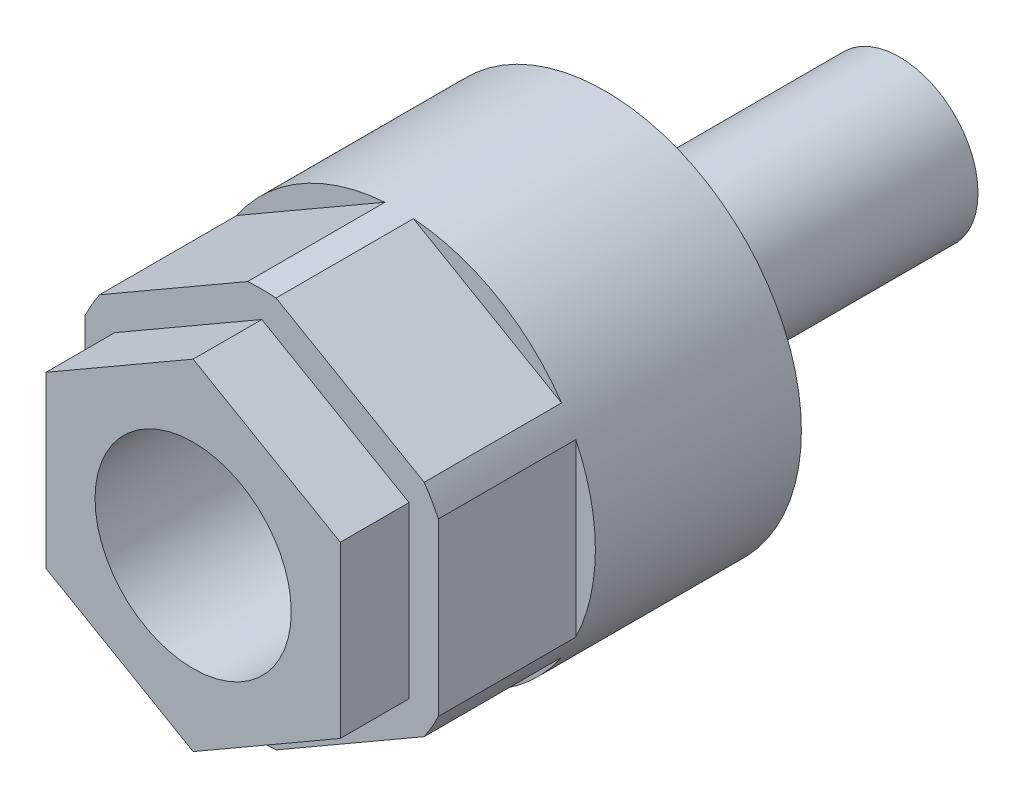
ISO-10303-21;
HEADER;
FILE_DESCRIPTION(('STEP AP214'),'2;1');
FILE_NAME('part.step','',(''),(''),'','','');
FILE_SCHEMA(('AUTOMOTIVE_DESIGN { 1 0 10303 214 1 1 1 1 }'));
ENDSEC;
DATA;
#1=APPLICATION_CONTEXT('core data for automotive mechanical design processes');
#2=APPLICATION_PROTOCOL_DEFINITION('international standard','automotive_design',2000,#1);
#3=PRODUCT_CONTEXT('',#1,'mechanical');
#4=PRODUCT('Part','Part','',(#3));
#5=PRODUCT_RELATED_PRODUCT_CATEGORY('part','',(#4));
#6=PRODUCT_DEFINITION_FORMATION('','',#4);
#7=PRODUCT_DEFINITION_CONTEXT('part definition',#1,'design');
#8=PRODUCT_DEFINITION('design','',#6,#7);
#9=PRODUCT_DEFINITION_SHAPE('','',#8);
#10=(LENGTH_UNIT() NAMED_UNIT(*) SI_UNIT(.MILLI.,.METRE.));
#11=(NAMED_UNIT(*) PLANE_ANGLE_UNIT() SI_UNIT($,.RADIAN.));
#12=(NAMED_UNIT(*) SI_UNIT($,.STERADIAN.) SOLID_ANGLE_UNIT());
#13=UNCERTAINTY_MEASURE_WITH_UNIT(LENGTH_MEASURE(1.E-05),#10,'distance_accuracy_value','');
#14=(GEOMETRIC_REPRESENTATION_CONTEXT(3) GLOBAL_UNCERTAINTY_ASSIGNED_CONTEXT((#13)) GLOBAL_UNIT_ASSIGNED_CONTEXT((#10,
#11,#12)) REPRESENTATION_CONTEXT('',''));
#15=CARTESIAN_POINT('',(0.,0.,0.));
#16=DIRECTION('',(0.,0.,1.));
#17=DIRECTION('',(1.,0.,0.));
#18=AXIS2_PLACEMENT_3D('',#15,#16,#17);
#19=CARTESIAN_POINT('',(0.,0.,80.));
#20=DIRECTION('',(0.,0.,1.));
#21=DIRECTION('',(1.,0.,0.));
#22=AXIS2_PLACEMENT_3D('',#19,#20,#21);
#23=CYLINDRICAL_SURFACE('',#22,20.);
#24=CARTESIAN_POINT('',(0.,0.,0.));
#25=DIRECTION('',(0.,0.,1.));
#26=DIRECTION('',(1.,0.,0.));
#27=AXIS2_PLACEMENT_3D('',#24,#25,#26);
#28=CIRCLE('',#27,20.);
#29=CARTESIAN_POINT('',(20.,0.,0.));
#30=VERTEX_POINT('',#29);
#31=EDGE_CURVE('E239',#30,#30,#28,.T.);
#32=ORIENTED_EDGE('',*,*,#31,.T.);
#33=EDGE_LOOP('',(#32));
#34=FACE_BOUND('',#33,.T.);
#35=DIRECTION('',(0.,0.,1.));
#36=VECTOR('',#35,1.);
#37=CARTESIAN_POINT('',(18.,-8.71779788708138,80.));
#38=LINE('',#37,#36);
#39=CARTESIAN_POINT('',(18.,-8.71779788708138,21.));
#40=VERTEX_POINT('',#39);
#41=CARTESIAN_POINT('',(18.,-8.71779788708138,35.));
#42=VERTEX_POINT('',#41);
#43=EDGE_CURVE('E269',#40,#42,#38,.T.);
#44=ORIENTED_EDGE('',*,*,#43,.T.);
#45=CARTESIAN_POINT('',(0.,0.,35.));
#46=DIRECTION('',(0.,0.,1.));
#47=DIRECTION('',(1.,0.,0.));
#48=AXIS2_PLACEMENT_3D('',#45,#46,#47);
#49=CIRCLE('',#48,20.);
#50=CARTESIAN_POINT('',(16.5498344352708,-11.2295583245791,35.));
#51=VERTEX_POINT('',#50);
#52=EDGE_CURVE('E206',#42,#51,#49,.F.);
#53=ORIENTED_EDGE('',*,*,#52,.T.);
#54=DIRECTION('',(0.,0.,1.));
#55=VECTOR('',#54,1.);
#56=CARTESIAN_POINT('',(16.5498344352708,-11.2295583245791,80.));
#57=LINE('',#56,#55);
#58=CARTESIAN_POINT('',(16.5498344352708,-11.2295583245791,21.));
#59=VERTEX_POINT('',#58);
#60=EDGE_CURVE('E263',#59,#51,#57,.T.);
#61=ORIENTED_EDGE('',*,*,#60,.F.);
#62=CARTESIAN_POINT('',(0.,0.,21.));
#63=DIRECTION('',(0.,0.,1.));
#64=DIRECTION('',(1.,0.,0.));
#65=AXIS2_PLACEMENT_3D('',#62,#63,#64);
#66=CIRCLE('',#65,20.);
#67=CARTESIAN_POINT('',(1.45016556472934,-19.9473562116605,21.));
#68=VERTEX_POINT('',#67);
#69=EDGE_CURVE('E266',#59,#68,#66,.F.);
#70=ORIENTED_EDGE('',*,*,#69,.T.);
#71=DIRECTION('',(0.,0.,1.));
#72=VECTOR('',#71,1.);
#73=CARTESIAN_POINT('',(1.45016556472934,-19.9473562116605,80.));
#74=LINE('',#73,#72);
#75=CARTESIAN_POINT('',(1.45016556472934,-19.9473562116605,35.));
#76=VERTEX_POINT('',#75);
#77=EDGE_CURVE('E267',#76,#68,#74,.F.);
#78=ORIENTED_EDGE('',*,*,#77,.F.);
#79=CARTESIAN_POINT('',(-1.45016556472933,-19.9473562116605,35.));
#80=VERTEX_POINT('',#79);
#81=EDGE_CURVE('E196',#76,#80,#49,.F.);
#82=ORIENTED_EDGE('',*,*,#81,.T.);
#83=DIRECTION('',(0.,0.,1.));
#84=VECTOR('',#83,1.);
#85=CARTESIAN_POINT('',(-1.45016556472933,-19.9473562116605,80.));
#86=LINE('',#85,#84);
#87=CARTESIAN_POINT('',(-1.45016556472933,-19.9473562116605,21.));
#88=VERTEX_POINT('',#87);
#89=EDGE_CURVE('E261',#80,#88,#86,.F.);
#90=ORIENTED_EDGE('',*,*,#89,.T.);
#91=CARTESIAN_POINT('',(-16.5498344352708,-11.2295583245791,21.));
#92=VERTEX_POINT('',#91);
#93=EDGE_CURVE('E260',#88,#92,#66,.F.);
#94=ORIENTED_EDGE('',*,*,#93,.T.);
#95=DIRECTION('',(0.,0.,1.));
#96=VECTOR('',#95,1.);
#97=CARTESIAN_POINT('',(-16.5498344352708,-11.2295583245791,80.));
#98=LINE('',#97,#96);
#99=CARTESIAN_POINT('',(-16.5498344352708,-11.2295583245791,35.));
#100=VERTEX_POINT('',#99);
#101=EDGE_CURVE('E257',#92,#100,#98,.T.);
#102=ORIENTED_EDGE('',*,*,#101,.T.);
#103=CARTESIAN_POINT('',(-18.,-8.71779788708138,35.));
#104=VERTEX_POINT('',#103);
#105=EDGE_CURVE('E208',#100,#104,#49,.F.);
#106=ORIENTED_EDGE('',*,*,#105,.T.);
#107=DIRECTION('',(0.,0.,1.));
#108=VECTOR('',#107,1.);
#109=CARTESIAN_POINT('',(-18.,-8.71779788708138,80.));
#110=LINE('',#109,#108);
#111=CARTESIAN_POINT('',(-18.,-8.71779788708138,21.));
#112=VERTEX_POINT('',#111);
#113=EDGE_CURVE('E252',#112,#104,#110,.T.);
#114=ORIENTED_EDGE('',*,*,#113,.F.);
#115=CARTESIAN_POINT('',(-18.,8.71779788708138,21.));
#116=VERTEX_POINT('',#115);
#117=EDGE_CURVE('E250',#112,#116,#66,.F.);
#118=ORIENTED_EDGE('',*,*,#117,.T.);
#119=DIRECTION('',(0.,0.,1.));
#120=VECTOR('',#119,1.);
#121=CARTESIAN_POINT('',(-18.,8.71779788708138,80.));
#122=LINE('',#121,#120);
#123=CARTESIAN_POINT('',(-18.,8.71779788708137,35.));
#124=VERTEX_POINT('',#123);
#125=EDGE_CURVE('E255',#124,#116,#122,.F.);
#126=ORIENTED_EDGE('',*,*,#125,.F.);
#127=CARTESIAN_POINT('',(-16.5498344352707,11.2295583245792,35.));
#128=VERTEX_POINT('',#127);
#129=EDGE_CURVE('E202',#124,#128,#49,.F.);
#130=ORIENTED_EDGE('',*,*,#129,.T.);
#131=DIRECTION('',(0.,0.,1.));
#132=VECTOR('',#131,1.);
#133=CARTESIAN_POINT('',(-16.5498344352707,11.2295583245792,80.));
#134=LINE('',#133,#132);
#135=CARTESIAN_POINT('',(-16.5498344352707,11.2295583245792,21.));
#136=VERTEX_POINT('',#135);
#137=EDGE_CURVE('E242',#136,#128,#134,.T.);
#138=ORIENTED_EDGE('',*,*,#137,.F.);
#139=CARTESIAN_POINT('',(-1.45016556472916,19.9473562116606,21.));
#140=VERTEX_POINT('',#139);
#141=EDGE_CURVE('E245',#136,#140,#66,.F.);
#142=ORIENTED_EDGE('',*,*,#141,.T.);
#143=DIRECTION('',(0.,0.,1.));
#144=VECTOR('',#143,1.);
#145=CARTESIAN_POINT('',(-1.45016556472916,19.9473562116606,80.));
#146=LINE('',#145,#144);
#147=CARTESIAN_POINT('',(-1.45016556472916,19.9473562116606,35.));
#148=VERTEX_POINT('',#147);
#149=EDGE_CURVE('E248',#148,#140,#146,.F.);
#150=ORIENTED_EDGE('',*,*,#149,.F.);
#151=CARTESIAN_POINT('',(1.45016556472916,19.9473562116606,35.));
#152=VERTEX_POINT('',#151);
#153=EDGE_CURVE('E195',#148,#152,#49,.F.);
#154=ORIENTED_EDGE('',*,*,#153,.T.);
#155=DIRECTION('',(0.,0.,1.));
#156=VECTOR('',#155,1.);
#157=CARTESIAN_POINT('',(1.45016556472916,19.9473562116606,80.));
#158=LINE('',#157,#156);
#159=CARTESIAN_POINT('',(1.45016556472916,19.9473562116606,21.));
#160=VERTEX_POINT('',#159);
#161=EDGE_CURVE('E23',#152,#160,#158,.F.);
#162=ORIENTED_EDGE('',*,*,#161,.T.);
#163=CARTESIAN_POINT('',(16.5498344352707,11.2295583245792,21.));
#164=VERTEX_POINT('',#163);
#165=EDGE_CURVE('E249',#160,#164,#66,.F.);
#166=ORIENTED_EDGE('',*,*,#165,.T.);
#167=DIRECTION('',(0.,0.,1.));
#168=VECTOR('',#167,1.);
#169=CARTESIAN_POINT('',(16.5498344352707,11.2295583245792,80.));
#170=LINE('',#169,#168);
#171=CARTESIAN_POINT('',(16.5498344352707,11.2295583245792,35.));
#172=VERTEX_POINT('',#171);
#173=EDGE_CURVE('E275',#164,#172,#170,.T.);
#174=ORIENTED_EDGE('',*,*,#173,.T.);
#175=CARTESIAN_POINT('',(18.,8.71779788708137,35.));
#176=VERTEX_POINT('',#175);
#177=EDGE_CURVE('E38',#172,#176,#49,.F.);
#178=ORIENTED_EDGE('',*,*,#177,.T.);
#179=DIRECTION('',(0.,0.,1.));
#180=VECTOR('',#179,1.);
#181=CARTESIAN_POINT('',(18.,8.71779788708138,80.));
#182=LINE('',#181,#180);
#183=CARTESIAN_POINT('',(18.,8.71779788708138,21.));
#184=VERTEX_POINT('',#183);
#185=EDGE_CURVE('E273',#176,#184,#182,.F.);
#186=ORIENTED_EDGE('',*,*,#185,.T.);
#187=EDGE_CURVE('E272',#184,#40,#66,.F.);
#188=ORIENTED_EDGE('',*,*,#187,.T.);
#189=EDGE_LOOP('',(#44,#53,#61,#70,#78,#82,#90,#94,#102,#106,#114,#118,#126,#130,#138,#142,#150,
#154,#162,#166,#174,#178,#186,#188));
#190=FACE_BOUND('',#189,.T.);
#191=ADVANCED_FACE('F14',(#34,#190),#23,.T.);
#192=CARTESIAN_POINT('',(-18.,10.3923048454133,21.));
#193=DIRECTION('',(0.5,-0.86602540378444,0.));
#194=DIRECTION('',(0.86602540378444,0.5,0.));
#195=AXIS2_PLACEMENT_3D('',#192,#193,#194);
#196=PLANE('',#195);
#197=DIRECTION('',(-0.86602540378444,-0.5,0.));
#198=VECTOR('',#197,1.);
#199=CARTESIAN_POINT('',(-18.,10.3923048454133,35.));
#200=LINE('',#199,#198);
#201=EDGE_CURVE('E200',#148,#128,#200,.T.);
#202=ORIENTED_EDGE('',*,*,#201,.F.);
#203=ORIENTED_EDGE('',*,*,#149,.T.);
#204=DIRECTION('',(0.86602540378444,0.5,0.));
#205=VECTOR('',#204,1.);
#206=CARTESIAN_POINT('',(-18.,10.3923048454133,21.));
#207=LINE('',#206,#205);
#208=EDGE_CURVE('E226',#136,#140,#207,.T.);
#209=ORIENTED_EDGE('',*,*,#208,.F.);
#210=ORIENTED_EDGE('',*,*,#137,.T.);
#211=EDGE_LOOP('',(#202,#203,#209,#210));
#212=FACE_BOUND('',#211,.T.);
#213=ADVANCED_FACE('F333',(#212),#196,.F.);
#214=CARTESIAN_POINT('',(-18.,-10.3923048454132,21.));
#215=DIRECTION('',(1.,0.,0.));
#216=DIRECTION('',(0.,0.,-1.));
#217=AXIS2_PLACEMENT_3D('',#214,#215,#216);
#218=PLANE('',#217);
#219=DIRECTION('',(0.,-1.,0.));
#220=VECTOR('',#219,1.);
#221=CARTESIAN_POINT('',(-18.,-10.3923048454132,35.));
#222=LINE('',#221,#220);
#223=EDGE_CURVE('E205',#124,#104,#222,.T.);
#224=ORIENTED_EDGE('',*,*,#223,.F.);
#225=ORIENTED_EDGE('',*,*,#125,.T.);
#226=DIRECTION('',(0.,1.,0.));
#227=VECTOR('',#226,1.);
#228=CARTESIAN_POINT('',(-18.,-10.3923048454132,21.));
#229=LINE('',#228,#227);
#230=EDGE_CURVE('E223',#112,#116,#229,.T.);
#231=ORIENTED_EDGE('',*,*,#230,.F.);
#232=ORIENTED_EDGE('',*,*,#113,.T.);
#233=EDGE_LOOP('',(#224,#225,#231,#232));
#234=FACE_BOUND('',#233,.T.);
#235=ADVANCED_FACE('F301',(#234),#218,.F.);
#236=CARTESIAN_POINT('',(-18.,-10.3923048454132,21.));
#237=DIRECTION('',(-0.5,-0.866025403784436,0.));
#238=DIRECTION('',(0.866025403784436,-0.5,0.));
#239=AXIS2_PLACEMENT_3D('',#236,#237,#238);
#240=PLANE('',#239);
#241=ORIENTED_EDGE('',*,*,#89,.F.);
#242=DIRECTION('',(-0.866025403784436,0.5,0.));
#243=VECTOR('',#242,1.);
#244=CARTESIAN_POINT('',(-18.,-10.3923048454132,35.));
#245=LINE('',#244,#243);
#246=EDGE_CURVE('E209',#80,#100,#245,.T.);
#247=ORIENTED_EDGE('',*,*,#246,.T.);
#248=ORIENTED_EDGE('',*,*,#101,.F.);
#249=DIRECTION('',(0.866025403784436,-0.5,0.));
#250=VECTOR('',#249,1.);
#251=CARTESIAN_POINT('',(-18.,-10.3923048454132,21.));
#252=LINE('',#251,#250);
#253=EDGE_CURVE('E220',#92,#88,#252,.T.);
#254=ORIENTED_EDGE('',*,*,#253,.T.);
#255=EDGE_LOOP('',(#241,#247,#248,#254));
#256=FACE_BOUND('',#255,.T.);
#257=ADVANCED_FACE('F398',(#256),#240,.T.);
#258=CARTESIAN_POINT('',(18.,-10.3923048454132,21.));
#259=DIRECTION('',(-0.5,0.866025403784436,0.));
#260=DIRECTION('',(-0.866025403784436,-0.5,0.));
#261=AXIS2_PLACEMENT_3D('',#258,#259,#260);
#262=PLANE('',#261);
#263=DIRECTION('',(0.866025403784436,0.5,0.));
#264=VECTOR('',#263,1.);
#265=CARTESIAN_POINT('',(18.,-10.3923048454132,35.));
#266=LINE('',#265,#264);
#267=EDGE_CURVE('E203',#76,#51,#266,.T.);
#268=ORIENTED_EDGE('',*,*,#267,.F.);
#269=ORIENTED_EDGE('',*,*,#77,.T.);
#270=DIRECTION('',(-0.866025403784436,-0.5,0.));
#271=VECTOR('',#270,1.);
#272=CARTESIAN_POINT('',(18.,-10.3923048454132,21.));
#273=LINE('',#272,#271);
#274=EDGE_CURVE('E217',#59,#68,#273,.T.);
#275=ORIENTED_EDGE('',*,*,#274,.F.);
#276=ORIENTED_EDGE('',*,*,#60,.T.);
#277=EDGE_LOOP('',(#268,#269,#275,#276));
#278=FACE_BOUND('',#277,.T.);
#279=ADVANCED_FACE('F401',(#278),#262,.F.);
#280=CARTESIAN_POINT('',(18.,-10.3923048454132,21.));
#281=DIRECTION('',(1.,0.,0.));
#282=DIRECTION('',(0.,0.,-1.));
#283=AXIS2_PLACEMENT_3D('',#280,#281,#282);
#284=PLANE('',#283);
#285=ORIENTED_EDGE('',*,*,#185,.F.);
#286=DIRECTION('',(0.,-1.,0.));
#287=VECTOR('',#286,1.);
#288=CARTESIAN_POINT('',(18.,-10.3923048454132,35.));
#289=LINE('',#288,#287);
#290=EDGE_CURVE('E197',#176,#42,#289,.T.);
#291=ORIENTED_EDGE('',*,*,#290,.T.);
#292=ORIENTED_EDGE('',*,*,#43,.F.);
#293=DIRECTION('',(0.,1.,0.));
#294=VECTOR('',#293,1.);
#295=CARTESIAN_POINT('',(18.,-10.3923048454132,21.));
#296=LINE('',#295,#294);
#297=EDGE_CURVE('E213',#40,#184,#296,.T.);
#298=ORIENTED_EDGE('',*,*,#297,.T.);
#299=EDGE_LOOP('',(#285,#291,#292,#298));
#300=FACE_BOUND('',#299,.T.);
#301=ADVANCED_FACE('F394',(#300),#284,.T.);
#302=CARTESIAN_POINT('',(18.,10.3923048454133,21.));
#303=DIRECTION('',(0.5,0.86602540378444,0.));
#304=DIRECTION('',(-0.86602540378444,0.5,0.));
#305=AXIS2_PLACEMENT_3D('',#302,#303,#304);
#306=PLANE('',#305);
#307=ORIENTED_EDGE('',*,*,#161,.F.);
#308=DIRECTION('',(0.86602540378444,-0.5,0.));
#309=VECTOR('',#308,1.);
#310=CARTESIAN_POINT('',(18.,10.3923048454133,35.));
#311=LINE('',#310,#309);
#312=EDGE_CURVE('E9',#152,#172,#311,.T.);
#313=ORIENTED_EDGE('',*,*,#312,.T.);
#314=ORIENTED_EDGE('',*,*,#173,.F.);
#315=DIRECTION('',(-0.86602540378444,0.5,0.));
#316=VECTOR('',#315,1.);
#317=CARTESIAN_POINT('',(18.,10.3923048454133,21.));
#318=LINE('',#317,#316);
#319=EDGE_CURVE('E212',#164,#160,#318,.T.);
#320=ORIENTED_EDGE('',*,*,#319,.T.);
#321=EDGE_LOOP('',(#307,#313,#314,#320));
#322=FACE_BOUND('',#321,.T.);
#323=ADVANCED_FACE('F310',(#322),#306,.T.);
#324=CARTESIAN_POINT('',(20.,0.,0.));
#325=DIRECTION('',(0.,0.,-1.));
#326=DIRECTION('',(-1.,0.,0.));
#327=AXIS2_PLACEMENT_3D('',#324,#325,#326);
#328=PLANE('',#327);
#329=CARTESIAN_POINT('',(0.,0.,0.));
#330=DIRECTION('',(0.,0.,1.));
#331=DIRECTION('',(1.,0.,0.));
#332=AXIS2_PLACEMENT_3D('',#329,#330,#331);
#333=CIRCLE('',#332,8.);
#334=CARTESIAN_POINT('',(8.,0.,0.));
#335=VERTEX_POINT('',#334);
#336=EDGE_CURVE('E236',#335,#335,#333,.T.);
#337=ORIENTED_EDGE('',*,*,#336,.T.);
#338=EDGE_LOOP('',(#337));
#339=FACE_BOUND('',#338,.T.);
#340=ORIENTED_EDGE('',*,*,#31,.F.);
#341=EDGE_LOOP('',(#340));
#342=FACE_BOUND('',#341,.T.);
#343=ADVANCED_FACE('F342',(#339,#342),#328,.T.);
#344=CARTESIAN_POINT('',(0.,0.,80.));
#345=DIRECTION('',(0.,0.,1.));
#346=DIRECTION('',(1.,0.,0.));
#347=AXIS2_PLACEMENT_3D('',#344,#345,#346);
#348=CYLINDRICAL_SURFACE('',#347,8.);
#349=CARTESIAN_POINT('',(0.,0.,-30.));
#350=DIRECTION('',(0.,0.,1.));
#351=DIRECTION('',(1.,0.,0.));
#352=AXIS2_PLACEMENT_3D('',#349,#350,#351);
#353=CIRCLE('',#352,8.);
#354=CARTESIAN_POINT('',(8.,0.,-30.));
#355=VERTEX_POINT('',#354);
#356=EDGE_CURVE('E18',#355,#355,#353,.F.);
#357=ORIENTED_EDGE('',*,*,#356,.F.);
#358=EDGE_LOOP('',(#357));
#359=FACE_BOUND('',#358,.T.);
#360=ORIENTED_EDGE('',*,*,#336,.F.);
#361=EDGE_LOOP('',(#360));
#362=FACE_BOUND('',#361,.T.);
#363=ADVANCED_FACE('F330',(#359,#362),#348,.T.);
#364=CARTESIAN_POINT('',(0.,0.,21.));
#365=DIRECTION('',(0.,0.,1.));
#366=DIRECTION('',(1.,0.,0.));
#367=AXIS2_PLACEMENT_3D('',#364,#365,#366);
#368=PLANE('',#367);
#369=ORIENTED_EDGE('',*,*,#208,.T.);
#370=ORIENTED_EDGE('',*,*,#141,.F.);
#371=EDGE_LOOP('',(#369,#370));
#372=FACE_BOUND('',#371,.T.);
#373=ADVANCED_FACE('F317',(#372),#368,.T.);
#374=ORIENTED_EDGE('',*,*,#230,.T.);
#375=ORIENTED_EDGE('',*,*,#117,.F.);
#376=EDGE_LOOP('',(#374,#375));
#377=FACE_BOUND('',#376,.T.);
#378=ADVANCED_FACE('F298',(#377),#368,.T.);
#379=ORIENTED_EDGE('',*,*,#253,.F.);
#380=ORIENTED_EDGE('',*,*,#93,.F.);
#381=EDGE_LOOP('',(#379,#380));
#382=FACE_BOUND('',#381,.T.);
#383=ADVANCED_FACE('F416',(#382),#368,.T.);
#384=ORIENTED_EDGE('',*,*,#274,.T.);
#385=ORIENTED_EDGE('',*,*,#69,.F.);
#386=EDGE_LOOP('',(#384,#385));
#387=FACE_BOUND('',#386,.T.);
#388=ADVANCED_FACE('F325',(#387),#368,.T.);
#389=ORIENTED_EDGE('',*,*,#297,.F.);
#390=ORIENTED_EDGE('',*,*,#187,.F.);
#391=EDGE_LOOP('',(#389,#390));
#392=FACE_BOUND('',#391,.T.);
#393=ADVANCED_FACE('F315',(#392),#368,.T.);
#394=ORIENTED_EDGE('',*,*,#319,.F.);
#395=ORIENTED_EDGE('',*,*,#165,.F.);
#396=EDGE_LOOP('',(#394,#395));
#397=FACE_BOUND('',#396,.T.);
#398=ADVANCED_FACE('F313',(#397),#368,.T.);
#399=CARTESIAN_POINT('',(0.,0.,35.));
#400=DIRECTION('',(0.,0.,1.));
#401=DIRECTION('',(1.,0.,0.));
#402=AXIS2_PLACEMENT_3D('',#399,#400,#401);
#403=PLANE('',#402);
#404=ORIENTED_EDGE('',*,*,#81,.F.);
#405=ORIENTED_EDGE('',*,*,#267,.T.);
#406=ORIENTED_EDGE('',*,*,#52,.F.);
#407=ORIENTED_EDGE('',*,*,#290,.F.);
#408=ORIENTED_EDGE('',*,*,#177,.F.);
#409=ORIENTED_EDGE('',*,*,#312,.F.);
#410=ORIENTED_EDGE('',*,*,#153,.F.);
#411=ORIENTED_EDGE('',*,*,#201,.T.);
#412=ORIENTED_EDGE('',*,*,#129,.F.);
#413=ORIENTED_EDGE('',*,*,#223,.T.);
#414=ORIENTED_EDGE('',*,*,#105,.F.);
#415=ORIENTED_EDGE('',*,*,#246,.F.);
#416=EDGE_LOOP('',(#404,#405,#406,#407,#408,#409,#410,#411,#412,#413,#414,#415));
#417=FACE_BOUND('',#416,.T.);
#418=DIRECTION('',(-0.866025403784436,-0.5,0.));
#419=VECTOR('',#418,1.);
#420=CARTESIAN_POINT('',(15.,-8.66025403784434,35.));
#421=LINE('',#420,#419);
#422=CARTESIAN_POINT('',(15.,-8.66025403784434,35.));
#423=VERTEX_POINT('',#422);
#424=CARTESIAN_POINT('',(0.,-17.3205080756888,35.));
#425=VERTEX_POINT('',#424);
#426=EDGE_CURVE('E183',#423,#425,#421,.T.);
#427=ORIENTED_EDGE('',*,*,#426,.T.);
#428=DIRECTION('',(0.866025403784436,-0.5,0.));
#429=VECTOR('',#428,1.);
#430=CARTESIAN_POINT('',(-15.,-8.66025403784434,35.));
#431=LINE('',#430,#429);
#432=CARTESIAN_POINT('',(-15.,-8.66025403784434,35.));
#433=VERTEX_POINT('',#432);
#434=EDGE_CURVE('E147',#433,#425,#431,.T.);
#435=ORIENTED_EDGE('',*,*,#434,.F.);
#436=DIRECTION('',(0.,1.,0.));
#437=VECTOR('',#436,1.);
#438=CARTESIAN_POINT('',(-15.,-8.66025403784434,35.));
#439=LINE('',#438,#437);
#440=CARTESIAN_POINT('',(-15.,8.66025403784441,35.));
#441=VERTEX_POINT('',#440);
#442=EDGE_CURVE('E179',#433,#441,#439,.T.);
#443=ORIENTED_EDGE('',*,*,#442,.T.);
#444=DIRECTION('',(0.866025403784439,0.5,0.));
#445=VECTOR('',#444,1.);
#446=CARTESIAN_POINT('',(-15.,8.66025403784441,35.));
#447=LINE('',#446,#445);
#448=CARTESIAN_POINT('',(0.,17.3205080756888,35.));
#449=VERTEX_POINT('',#448);
#450=EDGE_CURVE('E176',#441,#449,#447,.T.);
#451=ORIENTED_EDGE('',*,*,#450,.T.);
#452=DIRECTION('',(-0.866025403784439,0.5,0.));
#453=VECTOR('',#452,1.);
#454=CARTESIAN_POINT('',(15.,8.66025403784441,35.));
#455=LINE('',#454,#453);
#456=CARTESIAN_POINT('',(15.,8.66025403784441,35.));
#457=VERTEX_POINT('',#456);
#458=EDGE_CURVE('E173',#457,#449,#455,.T.);
#459=ORIENTED_EDGE('',*,*,#458,.F.);
#460=DIRECTION('',(0.,1.,0.));
#461=VECTOR('',#460,1.);
#462=CARTESIAN_POINT('',(15.,-8.66025403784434,35.));
#463=LINE('',#462,#461);
#464=EDGE_CURVE('E170',#423,#457,#463,.T.);
#465=ORIENTED_EDGE('',*,*,#464,.F.);
#466=EDGE_LOOP('',(#427,#435,#443,#451,#459,#465));
#467=FACE_BOUND('',#466,.T.);
#468=ADVANCED_FACE('F302',(#417,#467),#403,.T.);
#469=CARTESIAN_POINT('',(15.,-8.66025403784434,35.));
#470=DIRECTION('',(-0.5,0.866025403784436,0.));
#471=DIRECTION('',(-0.866025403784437,-0.5,0.));
#472=AXIS2_PLACEMENT_3D('',#469,#470,#471);
#473=PLANE('',#472);
#474=DIRECTION('',(0.,0.,1.));
#475=VECTOR('',#474,1.);
#476=CARTESIAN_POINT('',(0.,-17.3205080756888,35.));
#477=LINE('',#476,#475);
#478=CARTESIAN_POINT('',(0.,-17.3205080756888,42.));
#479=VERTEX_POINT('',#478);
#480=EDGE_CURVE('E140',#425,#479,#477,.T.);
#481=ORIENTED_EDGE('',*,*,#480,.F.);
#482=ORIENTED_EDGE('',*,*,#426,.F.);
#483=DIRECTION('',(0.,0.,1.));
#484=VECTOR('',#483,1.);
#485=CARTESIAN_POINT('',(15.,-8.66025403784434,35.));
#486=LINE('',#485,#484);
#487=CARTESIAN_POINT('',(15.,-8.66025403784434,42.));
#488=VERTEX_POINT('',#487);
#489=EDGE_CURVE('E156',#423,#488,#486,.T.);
#490=ORIENTED_EDGE('',*,*,#489,.T.);
#491=DIRECTION('',(-0.866025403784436,-0.5,0.));
#492=VECTOR('',#491,1.);
#493=CARTESIAN_POINT('',(15.,-8.66025403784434,42.));
#494=LINE('',#493,#492);
#495=EDGE_CURVE('E154',#488,#479,#494,.T.);
#496=ORIENTED_EDGE('',*,*,#495,.T.);
#497=EDGE_LOOP('',(#481,#482,#490,#496));
#498=FACE_BOUND('',#497,.T.);
#499=ADVANCED_FACE('F155',(#498),#473,.F.);
#500=CARTESIAN_POINT('',(-15.,-8.66025403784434,35.));
#501=DIRECTION('',(-0.5,-0.866025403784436,0.));
#502=DIRECTION('',(0.866025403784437,-0.5,0.));
#503=AXIS2_PLACEMENT_3D('',#500,#501,#502);
#504=PLANE('',#503);
#505=DIRECTION('',(0.,0.,1.));
#506=VECTOR('',#505,1.);
#507=CARTESIAN_POINT('',(-15.,-8.66025403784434,35.));
#508=LINE('',#507,#506);
#509=CARTESIAN_POINT('',(-15.,-8.66025403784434,42.));
#510=VERTEX_POINT('',#509);
#511=EDGE_CURVE('E151',#433,#510,#508,.T.);
#512=ORIENTED_EDGE('',*,*,#511,.F.);
#513=ORIENTED_EDGE('',*,*,#434,.T.);
#514=ORIENTED_EDGE('',*,*,#480,.T.);
#515=DIRECTION('',(0.866025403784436,-0.5,0.));
#516=VECTOR('',#515,1.);
#517=CARTESIAN_POINT('',(-15.,-8.66025403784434,42.));
#518=LINE('',#517,#516);
#519=EDGE_CURVE('E144',#510,#479,#518,.T.);
#520=ORIENTED_EDGE('',*,*,#519,.F.);
#521=EDGE_LOOP('',(#512,#513,#514,#520));
#522=FACE_BOUND('',#521,.T.);
#523=ADVANCED_FACE('F142',(#522),#504,.T.);
#524=CARTESIAN_POINT('',(-15.,-8.66025403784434,35.));
#525=DIRECTION('',(1.,0.,0.));
#526=DIRECTION('',(0.,0.,-1.));
#527=AXIS2_PLACEMENT_3D('',#524,#525,#526);
#528=PLANE('',#527);
#529=DIRECTION('',(0.,0.,1.));
#530=VECTOR('',#529,1.);
#531=CARTESIAN_POINT('',(-15.,8.66025403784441,35.));
#532=LINE('',#531,#530);
#533=CARTESIAN_POINT('',(-15.,8.66025403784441,42.));
#534=VERTEX_POINT('',#533);
#535=EDGE_CURVE('E191',#441,#534,#532,.T.);
#536=ORIENTED_EDGE('',*,*,#535,.F.);
#537=ORIENTED_EDGE('',*,*,#442,.F.);
#538=ORIENTED_EDGE('',*,*,#511,.T.);
#539=DIRECTION('',(0.,1.,0.));
#540=VECTOR('',#539,1.);
#541=CARTESIAN_POINT('',(-15.,-8.66025403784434,42.));
#542=LINE('',#541,#540);
#543=EDGE_CURVE('E164',#510,#534,#542,.T.);
#544=ORIENTED_EDGE('',*,*,#543,.T.);
#545=EDGE_LOOP('',(#536,#537,#538,#544));
#546=FACE_BOUND('',#545,.T.);
#547=ADVANCED_FACE('F386',(#546),#528,.F.);
#548=CARTESIAN_POINT('',(-15.,8.66025403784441,35.));
#549=DIRECTION('',(0.5,-0.86602540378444,0.));
#550=DIRECTION('',(0.86602540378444,0.5,0.));
#551=AXIS2_PLACEMENT_3D('',#548,#549,#550);
#552=PLANE('',#551);
#553=DIRECTION('',(0.,0.,1.));
#554=VECTOR('',#553,1.);
#555=CARTESIAN_POINT('',(0.,17.3205080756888,35.));
#556=LINE('',#555,#554);
#557=CARTESIAN_POINT('',(0.,17.3205080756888,42.));
#558=VERTEX_POINT('',#557);
#559=EDGE_CURVE('E189',#449,#558,#556,.T.);
#560=ORIENTED_EDGE('',*,*,#559,.F.);
#561=ORIENTED_EDGE('',*,*,#450,.F.);
#562=ORIENTED_EDGE('',*,*,#535,.T.);
#563=DIRECTION('',(0.866025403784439,0.5,0.));
#564=VECTOR('',#563,1.);
#565=CARTESIAN_POINT('',(-15.,8.66025403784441,42.));
#566=LINE('',#565,#564);
#567=EDGE_CURVE('E166',#534,#558,#566,.T.);
#568=ORIENTED_EDGE('',*,*,#567,.T.);
#569=EDGE_LOOP('',(#560,#561,#562,#568));
#570=FACE_BOUND('',#569,.T.);
#571=ADVANCED_FACE('F383',(#570),#552,.F.);
#572=CARTESIAN_POINT('',(15.,8.66025403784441,35.));
#573=DIRECTION('',(0.5,0.866025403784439,0.));
#574=DIRECTION('',(-0.86602540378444,0.5,0.));
#575=AXIS2_PLACEMENT_3D('',#572,#573,#574);
#576=PLANE('',#575);
#577=DIRECTION('',(0.,0.,1.));
#578=VECTOR('',#577,1.);
#579=CARTESIAN_POINT('',(15.,8.66025403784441,35.));
#580=LINE('',#579,#578);
#581=CARTESIAN_POINT('',(15.,8.66025403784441,42.));
#582=VERTEX_POINT('',#581);
#583=EDGE_CURVE('E187',#457,#582,#580,.T.);
#584=ORIENTED_EDGE('',*,*,#583,.F.);
#585=ORIENTED_EDGE('',*,*,#458,.T.);
#586=ORIENTED_EDGE('',*,*,#559,.T.);
#587=DIRECTION('',(-0.866025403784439,0.5,0.));
#588=VECTOR('',#587,1.);
#589=CARTESIAN_POINT('',(15.,8.66025403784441,42.));
#590=LINE('',#589,#588);
#591=EDGE_CURVE('E30',#582,#558,#590,.T.);
#592=ORIENTED_EDGE('',*,*,#591,.F.);
#593=EDGE_LOOP('',(#584,#585,#586,#592));
#594=FACE_BOUND('',#593,.T.);
#595=ADVANCED_FACE('F379',(#594),#576,.T.);
#596=CARTESIAN_POINT('',(15.,-8.66025403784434,35.));
#597=DIRECTION('',(1.,0.,0.));
#598=DIRECTION('',(0.,0.,-1.));
#599=AXIS2_PLACEMENT_3D('',#596,#597,#598);
#600=PLANE('',#599);
#601=ORIENTED_EDGE('',*,*,#464,.T.);
#602=ORIENTED_EDGE('',*,*,#583,.T.);
#603=DIRECTION('',(0.,1.,0.));
#604=VECTOR('',#603,1.);
#605=CARTESIAN_POINT('',(15.,-8.66025403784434,42.));
#606=LINE('',#605,#604);
#607=EDGE_CURVE('E185',#488,#582,#606,.T.);
#608=ORIENTED_EDGE('',*,*,#607,.F.);
#609=ORIENTED_EDGE('',*,*,#489,.F.);
#610=EDGE_LOOP('',(#601,#602,#608,#609));
#611=FACE_BOUND('',#610,.T.);
#612=ADVANCED_FACE('F352',(#611),#600,.T.);
#613=CARTESIAN_POINT('',(10.,0.,6.));
#614=DIRECTION('',(0.,0.,-1.));
#615=DIRECTION('',(-1.,0.,0.));
#616=AXIS2_PLACEMENT_3D('',#613,#614,#615);
#617=PLANE('',#616);
#618=CARTESIAN_POINT('',(0.,0.,6.));
#619=DIRECTION('',(0.,0.,1.));
#620=DIRECTION('',(1.,0.,0.));
#621=AXIS2_PLACEMENT_3D('',#618,#619,#620);
#622=CIRCLE('',#621,10.);
#623=CARTESIAN_POINT('',(10.,0.,6.));
#624=VERTEX_POINT('',#623);
#625=EDGE_CURVE('E233',#624,#624,#622,.T.);
#626=ORIENTED_EDGE('',*,*,#625,.T.);
#627=EDGE_LOOP('',(#626));
#628=FACE_BOUND('',#627,.T.);
#629=ADVANCED_FACE('F349',(#628),#617,.F.);
#630=CARTESIAN_POINT('',(0.,0.,80.));
#631=DIRECTION('',(0.,0.,1.));
#632=DIRECTION('',(1.,0.,0.));
#633=AXIS2_PLACEMENT_3D('',#630,#631,#632);
#634=CYLINDRICAL_SURFACE('',#633,10.);
#635=ORIENTED_EDGE('',*,*,#625,.F.);
#636=EDGE_LOOP('',(#635));
#637=FACE_BOUND('',#636,.T.);
#638=CARTESIAN_POINT('',(0.,0.,42.));
#639=DIRECTION('',(0.,0.,1.));
#640=DIRECTION('',(1.,0.,0.));
#641=AXIS2_PLACEMENT_3D('',#638,#639,#640);
#642=CIRCLE('',#641,10.);
#643=CARTESIAN_POINT('',(10.,0.,42.));
#644=VERTEX_POINT('',#643);
#645=EDGE_CURVE('E216',#644,#644,#642,.T.);
#646=ORIENTED_EDGE('',*,*,#645,.T.);
#647=EDGE_LOOP('',(#646));
#648=FACE_BOUND('',#647,.T.);
#649=ADVANCED_FACE('F351',(#637,#648),#634,.F.);
#650=CARTESIAN_POINT('',(20.,0.,42.));
#651=DIRECTION('',(0.,0.,-1.));
#652=DIRECTION('',(-1.,0.,0.));
#653=AXIS2_PLACEMENT_3D('',#650,#651,#652);
#654=PLANE('',#653);
#655=ORIENTED_EDGE('',*,*,#519,.T.);
#656=ORIENTED_EDGE('',*,*,#495,.F.);
#657=ORIENTED_EDGE('',*,*,#607,.T.);
#658=ORIENTED_EDGE('',*,*,#591,.T.);
#659=ORIENTED_EDGE('',*,*,#567,.F.);
#660=ORIENTED_EDGE('',*,*,#543,.F.);
#661=EDGE_LOOP('',(#655,#656,#657,#658,#659,#660));
#662=FACE_BOUND('',#661,.T.);
#663=ORIENTED_EDGE('',*,*,#645,.F.);
#664=EDGE_LOOP('',(#663));
#665=FACE_BOUND('',#664,.T.);
#666=ADVANCED_FACE('F16',(#662,#665),#654,.F.);
#667=CARTESIAN_POINT('',(-20.,30.,-30.));
#668=DIRECTION('',(0.,0.,1.));
#669=DIRECTION('',(1.,0.,0.));
#670=AXIS2_PLACEMENT_3D('',#667,#668,#669);
#671=PLANE('',#670);
#672=ORIENTED_EDGE('',*,*,#356,.T.);
#673=EDGE_LOOP('',(#672));
#674=FACE_BOUND('',#673,.T.);
#675=ADVANCED_FACE('F360',(#674),#671,.F.);
#676=CLOSED_SHELL('',(#191,#213,#235,#257,#279,#301,#323,#343,#363,#373,#378,#383,#388,#393,
#398,#468,#499,#523,#547,#571,#595,#612,#629,#649,#666,#675));
#677=MANIFOLD_SOLID_BREP('B1',#676);
#678=ADVANCED_BREP_SHAPE_REPRESENTATION('',(#18,#677),#14);
#679=SHAPE_DEFINITION_REPRESENTATION(#9,#678);
ENDSEC;
END-ISO-10303-21;
